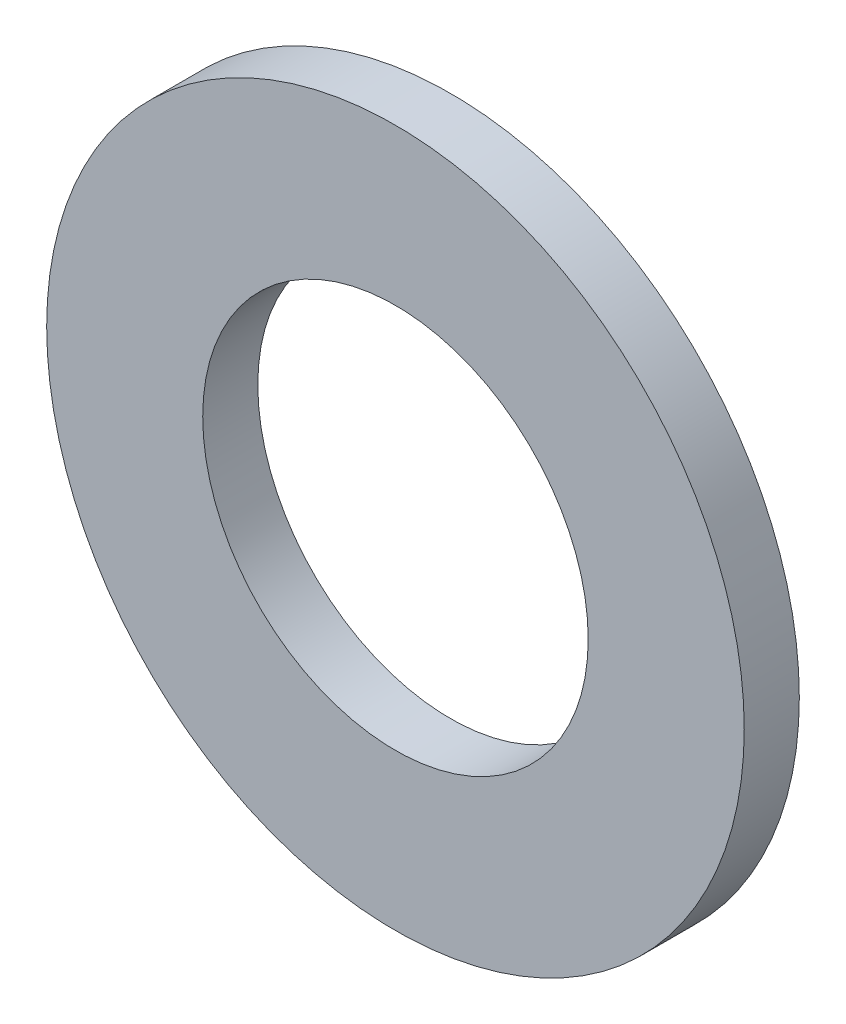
ISO-10303-21;
HEADER;
FILE_DESCRIPTION(('STEP AP214'),'2;1');
FILE_NAME('part.step','',(''),(''),'','','');
FILE_SCHEMA(('AUTOMOTIVE_DESIGN { 1 0 10303 214 1 1 1 1 }'));
ENDSEC;
DATA;
#1=APPLICATION_CONTEXT('core data for automotive mechanical design processes');
#2=APPLICATION_PROTOCOL_DEFINITION('international standard','automotive_design',2000,#1);
#3=PRODUCT_CONTEXT('',#1,'mechanical');
#4=PRODUCT('Part','Part','',(#3));
#5=PRODUCT_RELATED_PRODUCT_CATEGORY('part','',(#4));
#6=PRODUCT_DEFINITION_FORMATION('','',#4);
#7=PRODUCT_DEFINITION_CONTEXT('part definition',#1,'design');
#8=PRODUCT_DEFINITION('design','',#6,#7);
#9=PRODUCT_DEFINITION_SHAPE('','',#8);
#10=(LENGTH_UNIT() NAMED_UNIT(*) SI_UNIT(.MILLI.,.METRE.));
#11=(NAMED_UNIT(*) PLANE_ANGLE_UNIT() SI_UNIT($,.RADIAN.));
#12=(NAMED_UNIT(*) SI_UNIT($,.STERADIAN.) SOLID_ANGLE_UNIT());
#13=UNCERTAINTY_MEASURE_WITH_UNIT(LENGTH_MEASURE(1.E-05),#10,'distance_accuracy_value','');
#14=(GEOMETRIC_REPRESENTATION_CONTEXT(3) GLOBAL_UNCERTAINTY_ASSIGNED_CONTEXT((#13)) GLOBAL_UNIT_ASSIGNED_CONTEXT((#10,
#11,#12)) REPRESENTATION_CONTEXT('',''));
#15=CARTESIAN_POINT('',(0.,0.,0.));
#16=DIRECTION('',(0.,0.,1.));
#17=DIRECTION('',(1.,0.,0.));
#18=AXIS2_PLACEMENT_3D('',#15,#16,#17);
#19=CARTESIAN_POINT('',(0.,0.,1.5));
#20=DIRECTION('',(0.,0.,1.));
#21=DIRECTION('',(1.,0.,0.));
#22=AXIS2_PLACEMENT_3D('',#19,#20,#21);
#23=PLANE('',#22);
#24=CARTESIAN_POINT('',(0.,0.,1.5));
#25=DIRECTION('',(0.,0.,1.));
#26=DIRECTION('',(1.,0.,0.));
#27=AXIS2_PLACEMENT_3D('',#24,#25,#26);
#28=CIRCLE('',#27,9.5);
#29=CARTESIAN_POINT('',(9.5,0.,1.5));
#30=VERTEX_POINT('',#29);
#31=EDGE_CURVE('E12',#30,#30,#28,.T.);
#32=ORIENTED_EDGE('',*,*,#31,.T.);
#33=EDGE_LOOP('',(#32));
#34=FACE_BOUND('',#33,.T.);
#35=CARTESIAN_POINT('',(0.,0.,1.5));
#36=DIRECTION('',(0.,0.,1.));
#37=DIRECTION('',(1.,0.,0.));
#38=AXIS2_PLACEMENT_3D('',#35,#36,#37);
#39=CIRCLE('',#38,5.25);
#40=CARTESIAN_POINT('',(5.25,0.,1.5));
#41=VERTEX_POINT('',#40);
#42=EDGE_CURVE('E63',#41,#41,#39,.T.);
#43=ORIENTED_EDGE('',*,*,#42,.F.);
#44=EDGE_LOOP('',(#43));
#45=FACE_BOUND('',#44,.T.);
#46=ADVANCED_FACE('F49',(#34,#45),#23,.T.);
#47=CARTESIAN_POINT('',(0.,0.,0.));
#48=DIRECTION('',(0.,0.,1.));
#49=DIRECTION('',(1.,0.,0.));
#50=AXIS2_PLACEMENT_3D('',#47,#48,#49);
#51=PLANE('',#50);
#52=CARTESIAN_POINT('',(0.,0.,0.));
#53=DIRECTION('',(0.,0.,1.));
#54=DIRECTION('',(1.,0.,0.));
#55=AXIS2_PLACEMENT_3D('',#52,#53,#54);
#56=CIRCLE('',#55,9.5);
#57=CARTESIAN_POINT('',(9.5,0.,0.));
#58=VERTEX_POINT('',#57);
#59=EDGE_CURVE('E53',#58,#58,#56,.T.);
#60=ORIENTED_EDGE('',*,*,#59,.F.);
#61=EDGE_LOOP('',(#60));
#62=FACE_BOUND('',#61,.T.);
#63=CARTESIAN_POINT('',(0.,0.,0.));
#64=DIRECTION('',(0.,0.,1.));
#65=DIRECTION('',(1.,0.,0.));
#66=AXIS2_PLACEMENT_3D('',#63,#64,#65);
#67=CIRCLE('',#66,5.25);
#68=CARTESIAN_POINT('',(5.25,0.,0.));
#69=VERTEX_POINT('',#68);
#70=EDGE_CURVE('E65',#69,#69,#67,.T.);
#71=ORIENTED_EDGE('',*,*,#70,.T.);
#72=EDGE_LOOP('',(#71));
#73=FACE_BOUND('',#72,.T.);
#74=ADVANCED_FACE('F78',(#62,#73),#51,.F.);
#75=CARTESIAN_POINT('',(0.,0.,1.5));
#76=DIRECTION('',(0.,0.,-1.));
#77=DIRECTION('',(-1.,0.,0.));
#78=AXIS2_PLACEMENT_3D('',#75,#76,#77);
#79=CYLINDRICAL_SURFACE('',#78,9.5);
#80=ORIENTED_EDGE('',*,*,#31,.F.);
#81=EDGE_LOOP('',(#80));
#82=FACE_BOUND('',#81,.T.);
#83=ORIENTED_EDGE('',*,*,#59,.T.);
#84=EDGE_LOOP('',(#83));
#85=FACE_BOUND('',#84,.T.);
#86=ADVANCED_FACE('F51',(#82,#85),#79,.T.);
#87=CARTESIAN_POINT('',(0.,0.,1.5));
#88=DIRECTION('',(0.,0.,-1.));
#89=DIRECTION('',(-1.,0.,0.));
#90=AXIS2_PLACEMENT_3D('',#87,#88,#89);
#91=CYLINDRICAL_SURFACE('',#90,5.25);
#92=ORIENTED_EDGE('',*,*,#42,.T.);
#93=EDGE_LOOP('',(#92));
#94=FACE_BOUND('',#93,.T.);
#95=ORIENTED_EDGE('',*,*,#70,.F.);
#96=EDGE_LOOP('',(#95));
#97=FACE_BOUND('',#96,.T.);
#98=ADVANCED_FACE('F74',(#94,#97),#91,.F.);
#99=CLOSED_SHELL('',(#46,#74,#86,#98));
#100=MANIFOLD_SOLID_BREP('B2',#99);
#101=ADVANCED_BREP_SHAPE_REPRESENTATION('',(#18,#100),#14);
#102=SHAPE_DEFINITION_REPRESENTATION(#9,#101);
ENDSEC;
END-ISO-10303-21;
